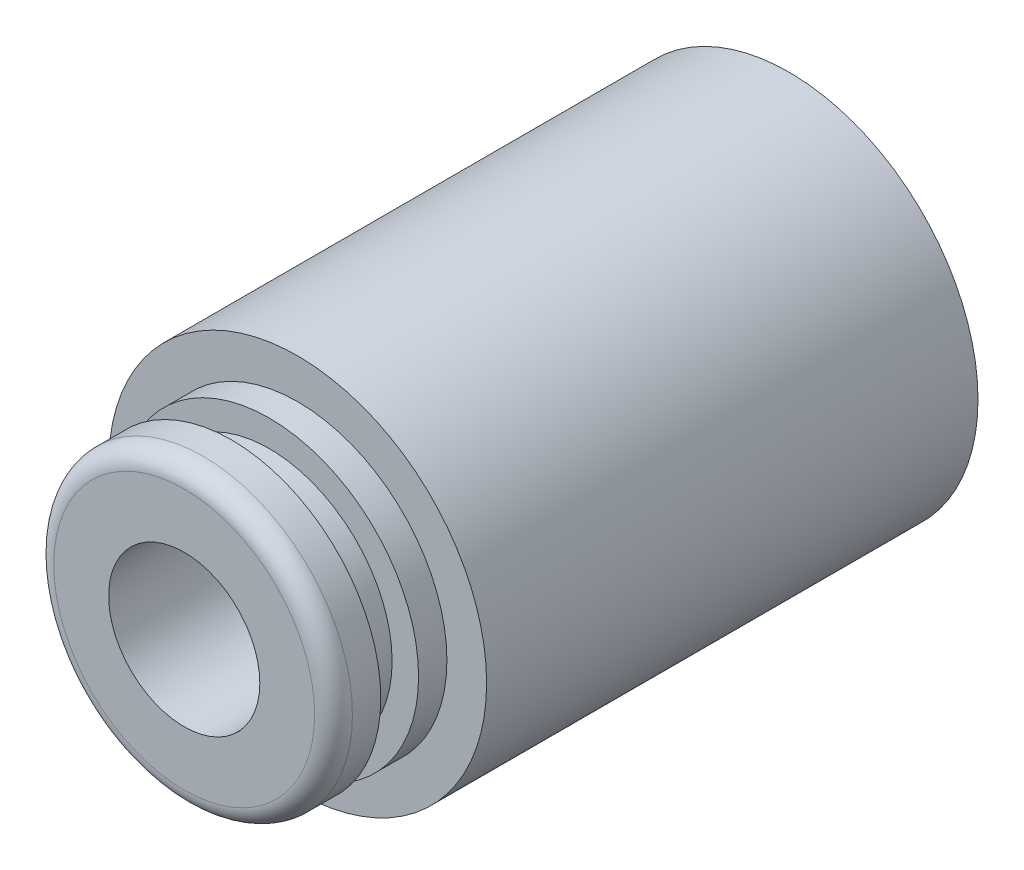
ISO-10303-21;
HEADER;
FILE_DESCRIPTION(('STEP AP214'),'2;1');
FILE_NAME('part.step','',(''),(''),'','','');
FILE_SCHEMA(('AUTOMOTIVE_DESIGN { 1 0 10303 214 1 1 1 1 }'));
ENDSEC;
DATA;
#1=APPLICATION_CONTEXT('core data for automotive mechanical design processes');
#2=APPLICATION_PROTOCOL_DEFINITION('international standard','automotive_design',2000,#1);
#3=PRODUCT_CONTEXT('',#1,'mechanical');
#4=PRODUCT('Part','Part','',(#3));
#5=PRODUCT_RELATED_PRODUCT_CATEGORY('part','',(#4));
#6=PRODUCT_DEFINITION_FORMATION('','',#4);
#7=PRODUCT_DEFINITION_CONTEXT('part definition',#1,'design');
#8=PRODUCT_DEFINITION('design','',#6,#7);
#9=PRODUCT_DEFINITION_SHAPE('','',#8);
#10=(LENGTH_UNIT() NAMED_UNIT(*) SI_UNIT(.MILLI.,.METRE.));
#11=(NAMED_UNIT(*) PLANE_ANGLE_UNIT() SI_UNIT($,.RADIAN.));
#12=(NAMED_UNIT(*) SI_UNIT($,.STERADIAN.) SOLID_ANGLE_UNIT());
#13=UNCERTAINTY_MEASURE_WITH_UNIT(LENGTH_MEASURE(1.E-05),#10,'distance_accuracy_value','');
#14=(GEOMETRIC_REPRESENTATION_CONTEXT(3) GLOBAL_UNCERTAINTY_ASSIGNED_CONTEXT((#13)) GLOBAL_UNIT_ASSIGNED_CONTEXT((#10,
#11,#12)) REPRESENTATION_CONTEXT('',''));
#15=CARTESIAN_POINT('',(0.,0.,0.));
#16=DIRECTION('',(0.,0.,1.));
#17=DIRECTION('',(1.,0.,0.));
#18=AXIS2_PLACEMENT_3D('',#15,#16,#17);
#19=CARTESIAN_POINT('',(0.,0.,13.75));
#20=DIRECTION('',(0.,0.,1.));
#21=DIRECTION('',(1.,0.,0.));
#22=AXIS2_PLACEMENT_3D('',#19,#20,#21);
#23=PLANE('',#22);
#24=CARTESIAN_POINT('',(0.,0.,13.75));
#25=DIRECTION('',(0.,0.,1.));
#26=DIRECTION('',(1.,0.,0.));
#27=AXIS2_PLACEMENT_3D('',#24,#25,#26);
#28=CIRCLE('',#27,3.95);
#29=CARTESIAN_POINT('',(3.94999999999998,0.,13.75));
#30=VERTEX_POINT('',#29);
#31=EDGE_CURVE('E50',#30,#30,#28,.T.);
#32=ORIENTED_EDGE('',*,*,#31,.T.);
#33=EDGE_LOOP('',(#32));
#34=FACE_BOUND('',#33,.T.);
#35=CARTESIAN_POINT('',(0.,0.,13.75));
#36=DIRECTION('',(0.,0.,1.));
#37=DIRECTION('',(1.,0.,0.));
#38=AXIS2_PLACEMENT_3D('',#35,#36,#37);
#39=CIRCLE('',#38,3.25);
#40=CARTESIAN_POINT('',(3.24999999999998,0.,13.75));
#41=VERTEX_POINT('',#40);
#42=EDGE_CURVE('E59',#41,#41,#39,.T.);
#43=ORIENTED_EDGE('',*,*,#42,.F.);
#44=EDGE_LOOP('',(#43));
#45=FACE_BOUND('',#44,.T.);
#46=ADVANCED_FACE('F27',(#34,#45),#23,.T.);
#47=CARTESIAN_POINT('',(0.,0.,13.));
#48=DIRECTION('',(0.,0.,1.));
#49=DIRECTION('',(1.,0.,0.));
#50=AXIS2_PLACEMENT_3D('',#47,#48,#49);
#51=PLANE('',#50);
#52=CARTESIAN_POINT('',(0.,0.,13.));
#53=DIRECTION('',(0.,0.,1.));
#54=DIRECTION('',(1.,0.,0.));
#55=AXIS2_PLACEMENT_3D('',#52,#53,#54);
#56=CIRCLE('',#55,5.);
#57=CARTESIAN_POINT('',(4.99999999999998,0.,13.));
#58=VERTEX_POINT('',#57);
#59=EDGE_CURVE('E38',#58,#58,#56,.T.);
#60=ORIENTED_EDGE('',*,*,#59,.T.);
#61=EDGE_LOOP('',(#60));
#62=FACE_BOUND('',#61,.T.);
#63=CARTESIAN_POINT('',(0.,0.,13.));
#64=DIRECTION('',(0.,0.,1.));
#65=DIRECTION('',(1.,0.,0.));
#66=AXIS2_PLACEMENT_3D('',#63,#64,#65);
#67=CIRCLE('',#66,3.95);
#68=CARTESIAN_POINT('',(3.94999999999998,0.,13.));
#69=VERTEX_POINT('',#68);
#70=EDGE_CURVE('E53',#69,#69,#67,.T.);
#71=ORIENTED_EDGE('',*,*,#70,.F.);
#72=EDGE_LOOP('',(#71));
#73=FACE_BOUND('',#72,.T.);
#74=ADVANCED_FACE('F86',(#62,#73),#51,.T.);
#75=CARTESIAN_POINT('',(0.,0.,0.));
#76=DIRECTION('',(0.,0.,1.));
#77=DIRECTION('',(1.,0.,0.));
#78=AXIS2_PLACEMENT_3D('',#75,#76,#77);
#79=PLANE('',#78);
#80=CARTESIAN_POINT('',(0.,0.,0.));
#81=DIRECTION('',(0.,0.,1.));
#82=DIRECTION('',(1.,0.,0.));
#83=AXIS2_PLACEMENT_3D('',#80,#81,#82);
#84=CIRCLE('',#83,5.);
#85=CARTESIAN_POINT('',(5.,0.,0.));
#86=VERTEX_POINT('',#85);
#87=EDGE_CURVE('E42',#86,#86,#84,.T.);
#88=ORIENTED_EDGE('',*,*,#87,.F.);
#89=EDGE_LOOP('',(#88));
#90=FACE_BOUND('',#89,.T.);
#91=CARTESIAN_POINT('',(0.,0.,0.));
#92=DIRECTION('',(0.,0.,1.));
#93=DIRECTION('',(1.,0.,0.));
#94=AXIS2_PLACEMENT_3D('',#91,#92,#93);
#95=CIRCLE('',#94,2.);
#96=CARTESIAN_POINT('',(2.,0.,0.));
#97=VERTEX_POINT('',#96);
#98=EDGE_CURVE('E47',#97,#97,#95,.T.);
#99=ORIENTED_EDGE('',*,*,#98,.T.);
#100=EDGE_LOOP('',(#99));
#101=FACE_BOUND('',#100,.T.);
#102=ADVANCED_FACE('F92',(#90,#101),#79,.F.);
#103=CARTESIAN_POINT('',(0.,0.,13.));
#104=DIRECTION('',(0.,0.,-1.));
#105=DIRECTION('',(-1.,0.,0.));
#106=AXIS2_PLACEMENT_3D('',#103,#104,#105);
#107=CYLINDRICAL_SURFACE('',#106,5.);
#108=ORIENTED_EDGE('',*,*,#59,.F.);
#109=EDGE_LOOP('',(#108));
#110=FACE_BOUND('',#109,.T.);
#111=ORIENTED_EDGE('',*,*,#87,.T.);
#112=EDGE_LOOP('',(#111));
#113=FACE_BOUND('',#112,.T.);
#114=ADVANCED_FACE('F29',(#110,#113),#107,.T.);
#115=CARTESIAN_POINT('',(0.,0.,13.));
#116=DIRECTION('',(0.,0.,-1.));
#117=DIRECTION('',(-1.,0.,0.));
#118=AXIS2_PLACEMENT_3D('',#115,#116,#117);
#119=CYLINDRICAL_SURFACE('',#118,2.);
#120=ORIENTED_EDGE('',*,*,#98,.F.);
#121=EDGE_LOOP('',(#120));
#122=FACE_BOUND('',#121,.T.);
#123=CARTESIAN_POINT('',(0.,0.,16.));
#124=DIRECTION('',(0.,0.,1.));
#125=DIRECTION('',(1.,0.,0.));
#126=AXIS2_PLACEMENT_3D('',#123,#124,#125);
#127=CIRCLE('',#126,2.);
#128=CARTESIAN_POINT('',(1.99999999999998,0.,16.));
#129=VERTEX_POINT('',#128);
#130=EDGE_CURVE('E65',#129,#129,#127,.T.);
#131=ORIENTED_EDGE('',*,*,#130,.T.);
#132=EDGE_LOOP('',(#131));
#133=FACE_BOUND('',#132,.T.);
#134=ADVANCED_FACE('F69',(#122,#133),#119,.F.);
#135=CARTESIAN_POINT('',(0.,0.,13.75));
#136=DIRECTION('',(0.,0.,-1.));
#137=DIRECTION('',(-1.,0.,0.));
#138=AXIS2_PLACEMENT_3D('',#135,#136,#137);
#139=CYLINDRICAL_SURFACE('',#138,3.95);
#140=ORIENTED_EDGE('',*,*,#31,.F.);
#141=EDGE_LOOP('',(#140));
#142=FACE_BOUND('',#141,.T.);
#143=ORIENTED_EDGE('',*,*,#70,.T.);
#144=EDGE_LOOP('',(#143));
#145=FACE_BOUND('',#144,.T.);
#146=ADVANCED_FACE('F97',(#142,#145),#139,.T.);
#147=CARTESIAN_POINT('',(0.,0.,14.75));
#148=DIRECTION('',(0.,0.,-1.));
#149=DIRECTION('',(-1.,0.,0.));
#150=AXIS2_PLACEMENT_3D('',#147,#148,#149);
#151=CYLINDRICAL_SURFACE('',#150,3.25);
#152=CARTESIAN_POINT('',(0.,0.,14.75));
#153=DIRECTION('',(0.,0.,1.));
#154=DIRECTION('',(1.,0.,0.));
#155=AXIS2_PLACEMENT_3D('',#152,#153,#154);
#156=CIRCLE('',#155,3.25);
#157=CARTESIAN_POINT('',(3.24999999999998,0.,14.75));
#158=VERTEX_POINT('',#157);
#159=EDGE_CURVE('E56',#158,#158,#156,.T.);
#160=ORIENTED_EDGE('',*,*,#159,.F.);
#161=EDGE_LOOP('',(#160));
#162=FACE_BOUND('',#161,.T.);
#163=ORIENTED_EDGE('',*,*,#42,.T.);
#164=EDGE_LOOP('',(#163));
#165=FACE_BOUND('',#164,.T.);
#166=ADVANCED_FACE('F82',(#162,#165),#151,.T.);
#167=CARTESIAN_POINT('',(0.,0.,14.75));
#168=DIRECTION('',(0.,0.,1.));
#169=DIRECTION('',(1.,0.,0.));
#170=AXIS2_PLACEMENT_3D('',#167,#168,#169);
#171=PLANE('',#170);
#172=CARTESIAN_POINT('',(0.,0.,14.75));
#173=DIRECTION('',(0.,0.,1.));
#174=DIRECTION('',(1.,0.,0.));
#175=AXIS2_PLACEMENT_3D('',#172,#173,#174);
#176=CIRCLE('',#175,3.95);
#177=CARTESIAN_POINT('',(3.94999999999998,0.,14.75));
#178=VERTEX_POINT('',#177);
#179=EDGE_CURVE('E62',#178,#178,#176,.T.);
#180=ORIENTED_EDGE('',*,*,#179,.F.);
#181=EDGE_LOOP('',(#180));
#182=FACE_BOUND('',#181,.T.);
#183=ORIENTED_EDGE('',*,*,#159,.T.);
#184=EDGE_LOOP('',(#183));
#185=FACE_BOUND('',#184,.T.);
#186=ADVANCED_FACE('F74',(#182,#185),#171,.F.);
#187=CARTESIAN_POINT('',(0.,0.,16.));
#188=DIRECTION('',(0.,0.,1.));
#189=DIRECTION('',(1.,0.,0.));
#190=AXIS2_PLACEMENT_3D('',#187,#188,#189);
#191=PLANE('',#190);
#192=CARTESIAN_POINT('',(0.,0.,16.));
#193=DIRECTION('',(0.,0.,1.));
#194=DIRECTION('',(1.,0.,0.));
#195=AXIS2_PLACEMENT_3D('',#192,#193,#194);
#196=CIRCLE('',#195,3.45);
#197=CARTESIAN_POINT('',(3.44999999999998,0.,16.));
#198=VERTEX_POINT('',#197);
#199=EDGE_CURVE('E34',#198,#198,#196,.T.);
#200=ORIENTED_EDGE('',*,*,#199,.T.);
#201=EDGE_LOOP('',(#200));
#202=FACE_BOUND('',#201,.T.);
#203=ORIENTED_EDGE('',*,*,#130,.F.);
#204=EDGE_LOOP('',(#203));
#205=FACE_BOUND('',#204,.T.);
#206=ADVANCED_FACE('F71',(#202,#205),#191,.T.);
#207=CARTESIAN_POINT('',(0.,0.,16.));
#208=DIRECTION('',(0.,0.,-1.));
#209=DIRECTION('',(-1.,0.,0.));
#210=AXIS2_PLACEMENT_3D('',#207,#208,#209);
#211=CYLINDRICAL_SURFACE('',#210,3.95);
#212=CARTESIAN_POINT('',(0.,0.,15.5));
#213=DIRECTION('',(0.,0.,1.));
#214=DIRECTION('',(1.,0.,0.));
#215=AXIS2_PLACEMENT_3D('',#212,#213,#214);
#216=CIRCLE('',#215,3.95);
#217=CARTESIAN_POINT('',(3.94999999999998,0.,15.5));
#218=VERTEX_POINT('',#217);
#219=EDGE_CURVE('E10',#218,#218,#216,.F.);
#220=ORIENTED_EDGE('',*,*,#219,.T.);
#221=EDGE_LOOP('',(#220));
#222=FACE_BOUND('',#221,.T.);
#223=ORIENTED_EDGE('',*,*,#179,.T.);
#224=EDGE_LOOP('',(#223));
#225=FACE_BOUND('',#224,.T.);
#226=ADVANCED_FACE('F73',(#222,#225),#211,.T.);
#227=CARTESIAN_POINT('',(0.,0.,15.5));
#228=DIRECTION('',(0.,0.,1.));
#229=DIRECTION('',(1.,0.,0.));
#230=AXIS2_PLACEMENT_3D('',#227,#228,#229);
#231=TOROIDAL_SURFACE('',#230,3.45,0.5);
#232=ORIENTED_EDGE('',*,*,#219,.F.);
#233=EDGE_LOOP('',(#232));
#234=FACE_BOUND('',#233,.T.);
#235=ORIENTED_EDGE('',*,*,#199,.F.);
#236=EDGE_LOOP('',(#235));
#237=FACE_BOUND('',#236,.T.);
#238=ADVANCED_FACE('F80',(#234,#237),#231,.T.);
#239=CLOSED_SHELL('',(#46,#74,#102,#114,#134,#146,#166,#186,#206,#226,#238));
#240=MANIFOLD_SOLID_BREP('B2',#239);
#241=ADVANCED_BREP_SHAPE_REPRESENTATION('',(#18,#240),#14);
#242=SHAPE_DEFINITION_REPRESENTATION(#9,#241);
ENDSEC;
END-ISO-10303-21;
